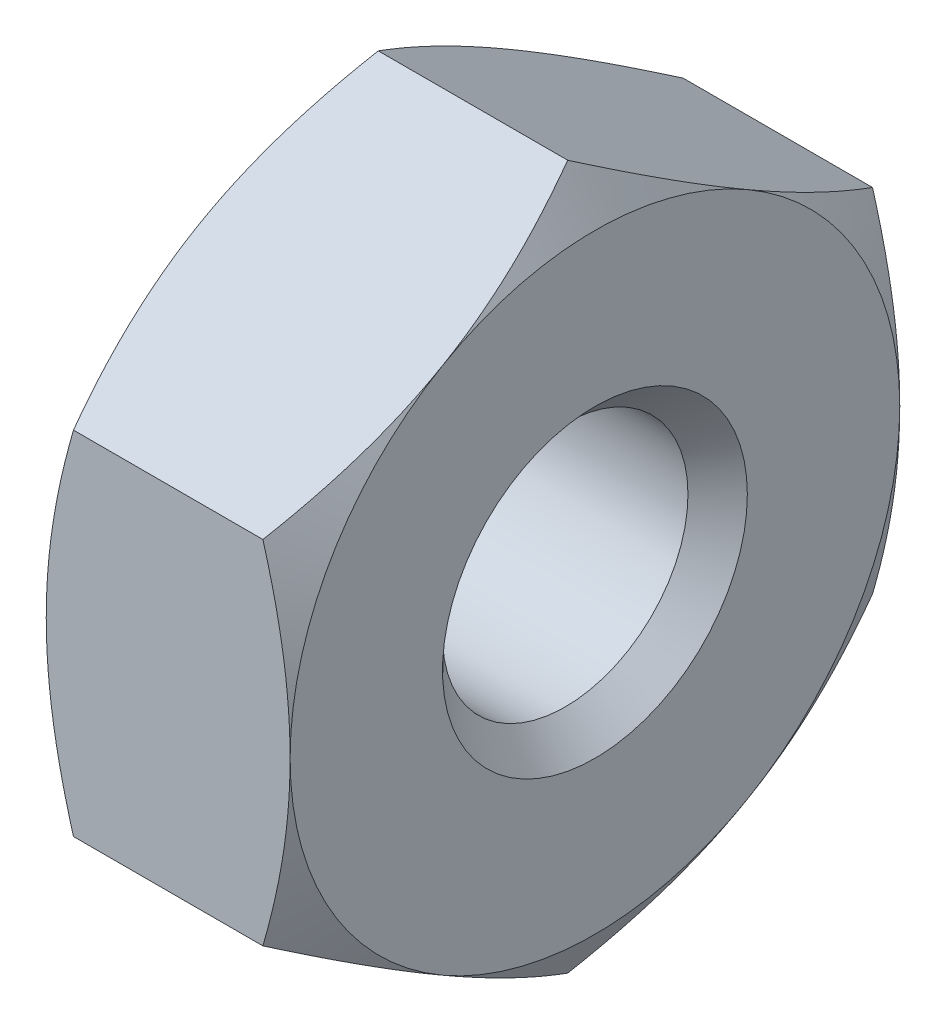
ISO-10303-21;
HEADER;
FILE_DESCRIPTION(('STEP AP214'),'2;1');
FILE_NAME('part.step','',(''),(''),'','','');
FILE_SCHEMA(('AUTOMOTIVE_DESIGN { 1 0 10303 214 1 1 1 1 }'));
ENDSEC;
DATA;
#1=APPLICATION_CONTEXT('core data for automotive mechanical design processes');
#2=APPLICATION_PROTOCOL_DEFINITION('international standard','automotive_design',2000,#1);
#3=PRODUCT_CONTEXT('',#1,'mechanical');
#4=PRODUCT('Part','Part','',(#3));
#5=PRODUCT_RELATED_PRODUCT_CATEGORY('part','',(#4));
#6=PRODUCT_DEFINITION_FORMATION('','',#4);
#7=PRODUCT_DEFINITION_CONTEXT('part definition',#1,'design');
#8=PRODUCT_DEFINITION('design','',#6,#7);
#9=PRODUCT_DEFINITION_SHAPE('','',#8);
#10=(LENGTH_UNIT() NAMED_UNIT(*) SI_UNIT(.MILLI.,.METRE.));
#11=(NAMED_UNIT(*) PLANE_ANGLE_UNIT() SI_UNIT($,.RADIAN.));
#12=(NAMED_UNIT(*) SI_UNIT($,.STERADIAN.) SOLID_ANGLE_UNIT());
#13=UNCERTAINTY_MEASURE_WITH_UNIT(LENGTH_MEASURE(1.E-05),#10,'distance_accuracy_value','');
#14=(GEOMETRIC_REPRESENTATION_CONTEXT(3) GLOBAL_UNCERTAINTY_ASSIGNED_CONTEXT((#13)) GLOBAL_UNIT_ASSIGNED_CONTEXT((#10,
#11,#12)) REPRESENTATION_CONTEXT('',''));
#15=CARTESIAN_POINT('',(0.,0.,0.));
#16=DIRECTION('',(0.,0.,1.));
#17=DIRECTION('',(1.,0.,0.));
#18=AXIS2_PLACEMENT_3D('',#15,#16,#17);
#19=CARTESIAN_POINT('',(2.,0.,0.));
#20=DIRECTION('',(-1.,0.,0.));
#21=DIRECTION('',(0.,0.,1.));
#22=AXIS2_PLACEMENT_3D('',#19,#20,#21);
#23=CONICAL_SURFACE('',#22,2.5,1.04719755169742);
#24=CARTESIAN_POINT('',(2.,0.,0.));
#25=DIRECTION('',(-1.,0.,0.));
#26=DIRECTION('',(0.,0.,1.));
#27=AXIS2_PLACEMENT_3D('',#24,#25,#26);
#28=CIRCLE('',#27,2.5);
#29=CARTESIAN_POINT('',(2.,4.80862169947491E-10,-2.5));
#30=VERTEX_POINT('',#29);
#31=CARTESIAN_POINT('',(1.99999999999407,2.16506350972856,-1.2499999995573));
#32=VERTEX_POINT('',#31);
#33=EDGE_CURVE('E129',#30,#32,#28,.F.);
#34=ORIENTED_EDGE('',*,*,#33,.F.);
#35=CARTESIAN_POINT('',(1.77670901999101,1.44337563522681,-2.50000000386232));
#36=CARTESIAN_POINT('',(1.81063132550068,1.32586499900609,-2.50000000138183));
#37=CARTESIAN_POINT('',(1.84171389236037,1.20744419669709,-2.50000000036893));
#38=CARTESIAN_POINT('',(1.89652773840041,0.9695584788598,-2.49999999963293));
#39=CARTESIAN_POINT('',(1.92029536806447,0.850101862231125,-2.49999999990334));
#40=CARTESIAN_POINT('',(1.95920267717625,0.609595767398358,-2.50000000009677));
#41=CARTESIAN_POINT('',(1.97433271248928,0.488544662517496,-2.50000000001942));
#42=CARTESIAN_POINT('',(1.98964324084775,0.306060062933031,-2.49999999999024));
#43=CARTESIAN_POINT('',(1.99351636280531,0.24492186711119,-2.49999999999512));
#44=CARTESIAN_POINT('',(1.99869890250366,0.122525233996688,-2.50000000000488));
#45=CARTESIAN_POINT('',(2.00000781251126,0.0612667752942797,-2.50000000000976));
#46=CARTESIAN_POINT('',(2.,3.39301441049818E-10,-2.5));
#47=B_SPLINE_CURVE_WITH_KNOTS('',3,(#35,#36,#37,#38,#39,#40,#41,#42,#43,#44,#45,#46),
.UNSPECIFIED.,.F.,.F.,(4,2,2,2,2,4),(0.,0.367018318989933,0.732182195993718,1.09775299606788,
1.28148745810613,1.46525829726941),.UNSPECIFIED.);
#48=CARTESIAN_POINT('',(1.77670900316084,1.44337566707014,-2.50000001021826));
#49=VERTEX_POINT('',#48);
#50=EDGE_CURVE('E21',#49,#30,#47,.T.);
#51=ORIENTED_EDGE('',*,*,#50,.F.);
#52=CARTESIAN_POINT('',(1.99999999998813,2.1650635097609,-1.24999999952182));
#53=CARTESIAN_POINT('',(2.00000781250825,2.13443012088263,-1.30305858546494));
#54=CARTESIAN_POINT('',(1.99869890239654,2.10380089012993,-1.3561099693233));
#55=CARTESIAN_POINT('',(1.99351636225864,2.04260257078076,-1.46210856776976));
#56=CARTESIAN_POINT('',(1.989643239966,2.0120334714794,-1.51505580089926));
#57=CARTESIAN_POINT('',(1.97433271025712,1.92079116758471,-1.67309210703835));
#58=CARTESIAN_POINT('',(1.95920267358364,1.86026561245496,-1.77792544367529));
#59=CARTESIAN_POINT('',(1.92029536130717,1.74001255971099,-1.98620984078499));
#60=CARTESIAN_POINT('',(1.89652772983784,1.68028424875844,-2.08966231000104));
#61=CARTESIAN_POINT('',(1.8417138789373,1.56134138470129,-2.29567739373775));
#62=CARTESIAN_POINT('',(1.81063130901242,1.50213098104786,-2.39823282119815));
#63=CARTESIAN_POINT('',(1.77670899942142,1.44337566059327,-2.50000002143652));
#64=B_SPLINE_CURVE_WITH_KNOTS('',3,(#52,#53,#54,#55,#56,#57,#58,#59,#60,#61,#62,#63),
.UNSPECIFIED.,.F.,.F.,(4,2,2,2,2,4),(0.,0.183770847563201,0.367505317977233,0.733076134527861,
1.09824002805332,1.46525836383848),.UNSPECIFIED.);
#65=EDGE_CURVE('E110',#32,#49,#64,.T.);
#66=ORIENTED_EDGE('',*,*,#65,.F.);
#67=EDGE_LOOP('',(#34,#51,#66));
#68=FACE_BOUND('',#67,.T.);
#69=ADVANCED_FACE('F17',(#68),#23,.T.);
#70=CARTESIAN_POINT('',(2.,0.,0.));
#71=DIRECTION('',(-1.,0.,0.));
#72=DIRECTION('',(0.,0.,1.));
#73=AXIS2_PLACEMENT_3D('',#70,#71,#72);
#74=CONICAL_SURFACE('',#73,2.5,1.04719755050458);
#75=CARTESIAN_POINT('',(2.,0.,0.));
#76=DIRECTION('',(-1.,0.,0.));
#77=DIRECTION('',(0.,0.,1.));
#78=AXIS2_PLACEMENT_3D('',#75,#76,#77);
#79=CIRCLE('',#78,2.5);
#80=CARTESIAN_POINT('',(1.99999999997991,2.16506350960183,1.24999999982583));
#81=VERTEX_POINT('',#80);
#82=EDGE_CURVE('E134',#32,#81,#79,.F.);
#83=ORIENTED_EDGE('',*,*,#82,.F.);
#84=CARTESIAN_POINT('',(1.77670900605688,2.88675134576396,-4.08838661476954E-10));
#85=CARTESIAN_POINT('',(1.81063131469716,2.82799602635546,-0.101767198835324));
#86=CARTESIAN_POINT('',(1.8417138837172,2.76878562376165,-0.204322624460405));
#87=CARTESIAN_POINT('',(1.89652773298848,2.64984276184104,-0.410337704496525));
#88=CARTESIAN_POINT('',(1.92029536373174,2.59011445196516,-0.513790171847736));
#89=CARTESIAN_POINT('',(1.95920267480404,2.46986140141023,-0.722074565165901));
#90=CARTESIAN_POINT('',(1.9743327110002,2.40933584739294,-0.826907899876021));
#91=CARTESIAN_POINT('',(1.98964324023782,2.31809354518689,-0.984944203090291));
#92=CARTESIAN_POINT('',(1.99351636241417,2.28752444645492,-1.03789143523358));
#93=CARTESIAN_POINT('',(1.99869890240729,2.22632612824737,-1.14389003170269));
#94=CARTESIAN_POINT('',(2.00000781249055,2.19569689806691,-1.19694141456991));
#95=CARTESIAN_POINT('',(1.99999999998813,2.1650635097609,-1.24999999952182));
#96=B_SPLINE_CURVE_WITH_KNOTS('',3,(#84,#85,#86,#87,#88,#89,#90,#91,#92,#93,#94,#95),
.UNSPECIFIED.,.F.,.F.,(4,2,2,2,2,4),(0.,0.367018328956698,0.732182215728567,1.09775302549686,
1.28148749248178,1.46525833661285),.UNSPECIFIED.);
#97=CARTESIAN_POINT('',(1.77670900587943,2.88675134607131,-1.23503307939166E-10));
#98=VERTEX_POINT('',#97);
#99=EDGE_CURVE('E116',#98,#32,#96,.T.);
#100=ORIENTED_EDGE('',*,*,#99,.F.);
#101=CARTESIAN_POINT('',(1.99999999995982,2.16506350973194,1.24999999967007));
#102=CARTESIAN_POINT('',(2.00000781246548,2.19569689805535,1.19694141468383));
#103=CARTESIAN_POINT('',(1.99869890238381,2.22632612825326,1.14389003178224));
#104=CARTESIAN_POINT('',(1.99351636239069,2.28752444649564,1.03789143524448));
#105=CARTESIAN_POINT('',(1.98964324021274,2.31809354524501,0.984944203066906));
#106=CARTESIAN_POINT('',(1.97433271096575,2.40933584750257,0.826907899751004));
#107=CARTESIAN_POINT('',(1.95920267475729,2.46986140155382,0.72207456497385));
#108=CARTESIAN_POINT('',(1.92029536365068,2.5901144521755,0.513790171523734));
#109=CARTESIAN_POINT('',(1.89652773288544,2.64984276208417,0.410337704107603));
#110=CARTESIAN_POINT('',(1.84171388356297,2.76878562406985,0.204322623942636));
#111=CARTESIAN_POINT('',(1.81063131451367,2.8279960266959,0.101767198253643));
#112=CARTESIAN_POINT('',(1.776709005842,2.88675134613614,-2.35798948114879E-10));
#113=B_SPLINE_CURVE_WITH_KNOTS('',3,(#101,#102,#103,#104,#105,#106,#107,#108,#109,#110,#111,
#112),.UNSPECIFIED.,.F.,.F.,(4,2,2,2,2,4),(0.,0.183770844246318,0.367505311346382,
0.733076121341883,1.09824000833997,1.46525833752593),.UNSPECIFIED.);
#114=EDGE_CURVE('E379',#81,#98,#113,.T.);
#115=ORIENTED_EDGE('',*,*,#114,.F.);
#116=EDGE_LOOP('',(#83,#100,#115));
#117=FACE_BOUND('',#116,.T.);
#118=ADVANCED_FACE('F378',(#117),#74,.T.);
#119=CARTESIAN_POINT('',(2.,0.,0.));
#120=DIRECTION('',(-1.,0.,0.));
#121=DIRECTION('',(0.,0.,1.));
#122=AXIS2_PLACEMENT_3D('',#119,#120,#121);
#123=CONICAL_SURFACE('',#122,2.5,1.04719755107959);
#124=CARTESIAN_POINT('',(1.77670899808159,-1.44337570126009,2.5));
#125=CARTESIAN_POINT('',(1.81063130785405,-1.32586506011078,2.5));
#126=CARTESIAN_POINT('',(1.84171387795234,-1.2074442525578,2.5));
#127=CARTESIAN_POINT('',(1.89652772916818,-0.969558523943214,2.5));
#128=CARTESIAN_POINT('',(1.92029536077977,-0.850101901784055,2.5));
#129=CARTESIAN_POINT('',(1.95920267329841,-0.609595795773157,2.5));
#130=CARTESIAN_POINT('',(1.97433271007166,-0.488544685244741,2.5));
#131=CARTESIAN_POINT('',(1.98964323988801,-0.306060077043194,2.5));
#132=CARTESIAN_POINT('',(1.99351636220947,-0.24492187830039,2.5));
#133=CARTESIAN_POINT('',(1.99869890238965,-0.12252523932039,2.5));
#134=CARTESIAN_POINT('',(2.00000781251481,-0.061266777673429,2.5));
#135=CARTESIAN_POINT('',(2.,2.24877682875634E-10,2.5));
#136=B_SPLINE_CURVE_WITH_KNOTS('',3,(#124,#125,#126,#127,#128,#129,#130,#131,#132,#133,#134,
#135),.UNSPECIFIED.,.F.,.F.,(4,2,2,2,2,4),(0.,0.367018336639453,0.732182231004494,
1.09775304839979,1.28148751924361,1.46525836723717),.UNSPECIFIED.);
#137=CARTESIAN_POINT('',(1.77670901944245,-1.44337569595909,2.49999996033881));
#138=VERTEX_POINT('',#137);
#139=CARTESIAN_POINT('',(2.,2.56379056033E-10,2.5));
#140=VERTEX_POINT('',#139);
#141=EDGE_CURVE('E148',#138,#140,#136,.T.);
#142=ORIENTED_EDGE('',*,*,#141,.F.);
#143=CARTESIAN_POINT('',(1.99999999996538,-2.16506350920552,1.25000000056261));
#144=CARTESIAN_POINT('',(2.00000781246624,-2.13443012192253,1.30305858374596));
#145=CARTESIAN_POINT('',(1.99869890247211,-2.10380089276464,1.35610996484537));
#146=CARTESIAN_POINT('',(1.99351636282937,-2.04260257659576,1.4621085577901));
#147=CARTESIAN_POINT('',(1.98964324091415,-2.01203347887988,1.51505578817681));
#148=CARTESIAN_POINT('',(1.97433271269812,-1.92079117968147,1.67309208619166));
#149=CARTESIAN_POINT('',(1.95920267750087,-1.86026562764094,1.77792541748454));
#150=CARTESIAN_POINT('',(1.92029536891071,-1.74001258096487,1.98620980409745));
#151=CARTESIAN_POINT('',(1.89652773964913,-1.68028427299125,2.08966226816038));
#152=CARTESIAN_POINT('',(1.84171389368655,-1.56134141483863,2.29567734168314));
#153=CARTESIAN_POINT('',(1.81063132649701,-1.50213101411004,2.39823276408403));
#154=CARTESIAN_POINT('',(1.77670901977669,-1.443375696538,2.4999999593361));
#155=B_SPLINE_CURVE_WITH_KNOTS('',3,(#143,#144,#145,#146,#147,#148,#149,#150,#151,#152,#153,
#154),.UNSPECIFIED.,.F.,.F.,(4,2,2,2,2,4),(0.,0.183770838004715,0.36750529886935,
0.733076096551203,1.09823997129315,1.46525828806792),.UNSPECIFIED.);
#156=CARTESIAN_POINT('',(2.,-2.16506350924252,1.25000000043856));
#157=VERTEX_POINT('',#156);
#158=EDGE_CURVE('E381',#157,#138,#155,.T.);
#159=ORIENTED_EDGE('',*,*,#158,.F.);
#160=CARTESIAN_POINT('',(2.,0.,0.));
#161=DIRECTION('',(-1.,0.,0.));
#162=DIRECTION('',(0.,0.,1.));
#163=AXIS2_PLACEMENT_3D('',#160,#161,#162);
#164=CIRCLE('',#163,2.5);
#165=EDGE_CURVE('E155',#140,#157,#164,.F.);
#166=ORIENTED_EDGE('',*,*,#165,.F.);
#167=EDGE_LOOP('',(#142,#159,#166));
#168=FACE_BOUND('',#167,.T.);
#169=ADVANCED_FACE('F181',(#168),#123,.T.);
#170=CARTESIAN_POINT('',(2.,0.,0.));
#171=DIRECTION('',(-1.,0.,0.));
#172=DIRECTION('',(0.,0.,1.));
#173=AXIS2_PLACEMENT_3D('',#170,#171,#172);
#174=CONICAL_SURFACE('',#173,2.5,1.04719755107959);
#175=CARTESIAN_POINT('',(1.77670899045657,-1.44337564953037,-2.50000001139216));
#176=CARTESIAN_POINT('',(1.81063130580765,-1.50213097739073,-2.39823281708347));
#177=CARTESIAN_POINT('',(1.84171387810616,-1.56134138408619,-2.29567739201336));
#178=CARTESIAN_POINT('',(1.89652773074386,-1.68028425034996,-2.08966231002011));
#179=CARTESIAN_POINT('',(1.920295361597,-1.7400125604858,-1.98620984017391));
#180=CARTESIAN_POINT('',(1.95920267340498,-1.86026561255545,-1.77792544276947));
#181=CARTESIAN_POINT('',(1.97433271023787,-1.92079116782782,-1.67309210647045));
#182=CARTESIAN_POINT('',(1.98964323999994,-2.01203347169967,-1.51505580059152));
#183=CARTESIAN_POINT('',(1.99351636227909,-2.04260257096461,-1.46210856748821));
#184=CARTESIAN_POINT('',(1.99869890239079,-2.10380089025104,-1.35610996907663));
#185=CARTESIAN_POINT('',(2.00000781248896,-2.13443012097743,-1.30305858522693));
#186=CARTESIAN_POINT('',(1.99999999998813,-2.16506350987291,-1.24999999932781));
#187=B_SPLINE_CURVE_WITH_KNOTS('',3,(#175,#176,#177,#178,#179,#180,#181,#182,#183,#184,#185,
#186),.UNSPECIFIED.,.F.,.F.,(4,2,2,2,2,4),(0.,0.367018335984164,0.732182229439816,
1.09775304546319,1.28148751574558,1.46525836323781),.UNSPECIFIED.);
#188=CARTESIAN_POINT('',(1.7767090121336,-1.44337565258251,-2.5));
#189=VERTEX_POINT('',#188);
#190=CARTESIAN_POINT('',(2.,-2.16506350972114,-1.24999999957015));
#191=VERTEX_POINT('',#190);
#192=EDGE_CURVE('E145',#189,#191,#187,.T.);
#193=ORIENTED_EDGE('',*,*,#192,.F.);
#194=CARTESIAN_POINT('',(2.,3.39301388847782E-10,-2.5));
#195=CARTESIAN_POINT('',(2.00000781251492,-0.0612667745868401,-2.5));
#196=CARTESIAN_POINT('',(1.99869890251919,-0.122525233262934,-2.5));
#197=CARTESIAN_POINT('',(1.99351636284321,-0.244921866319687,-2.5));
#198=CARTESIAN_POINT('',(1.98964324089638,-0.306060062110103,-2.5));
#199=CARTESIAN_POINT('',(1.97433271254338,-0.48854466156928,-2.5));
#200=CARTESIAN_POINT('',(1.95920267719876,-0.609595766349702,-2.5));
#201=CARTESIAN_POINT('',(1.92029536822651,-0.850101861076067,-2.5));
#202=CARTESIAN_POINT('',(1.89652773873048,-0.969558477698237,-2.5));
#203=CARTESIAN_POINT('',(1.84171389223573,-1.20744419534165,-2.5));
#204=CARTESIAN_POINT('',(1.81063132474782,-1.32586499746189,-2.5));
#205=CARTESIAN_POINT('',(1.77670901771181,-1.44337563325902,-2.5));
#206=B_SPLINE_CURVE_WITH_KNOTS('',3,(#194,#195,#196,#197,#198,#199,#200,#201,#202,#203,#204,
#205),.UNSPECIFIED.,.F.,.F.,(4,2,2,2,2,4),(0.,0.183770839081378,0.36750530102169,
0.733076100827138,1.09823997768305,1.46525829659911),.UNSPECIFIED.);
#207=EDGE_CURVE('E140',#30,#189,#206,.T.);
#208=ORIENTED_EDGE('',*,*,#207,.F.);
#209=CARTESIAN_POINT('',(2.,0.,0.));
#210=DIRECTION('',(-1.,0.,0.));
#211=DIRECTION('',(0.,0.,1.));
#212=AXIS2_PLACEMENT_3D('',#209,#210,#211);
#213=CIRCLE('',#212,2.5);
#214=EDGE_CURVE('E142',#191,#30,#213,.F.);
#215=ORIENTED_EDGE('',*,*,#214,.F.);
#216=EDGE_LOOP('',(#193,#208,#215));
#217=FACE_BOUND('',#216,.T.);
#218=ADVANCED_FACE('F141',(#217),#174,.T.);
#219=CARTESIAN_POINT('',(1.7565,0.,0.));
#220=DIRECTION('',(1.,0.,0.));
#221=DIRECTION('',(0.,0.,-1.));
#222=AXIS2_PLACEMENT_3D('',#219,#220,#221);
#223=CONICAL_SURFACE('',#222,1.0065,0.785398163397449);
#224=CARTESIAN_POINT('',(1.75650000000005,0.,0.));
#225=DIRECTION('',(1.,0.,0.));
#226=DIRECTION('',(0.,0.,-1.));
#227=AXIS2_PLACEMENT_3D('',#224,#225,#226);
#228=CIRCLE('',#227,1.0065);
#229=CARTESIAN_POINT('',(1.7565,0.,-1.0065));
#230=VERTEX_POINT('',#229);
#231=EDGE_CURVE('E135',#230,#230,#228,.F.);
#232=ORIENTED_EDGE('',*,*,#231,.T.);
#233=EDGE_LOOP('',(#232));
#234=FACE_BOUND('',#233,.T.);
#235=CARTESIAN_POINT('',(2.,0.,0.));
#236=DIRECTION('',(1.,0.,0.));
#237=DIRECTION('',(0.,0.,-1.));
#238=AXIS2_PLACEMENT_3D('',#235,#236,#237);
#239=CIRCLE('',#238,1.25);
#240=CARTESIAN_POINT('',(2.,0.,-1.25));
#241=VERTEX_POINT('',#240);
#242=EDGE_CURVE('E154',#241,#241,#239,.F.);
#243=ORIENTED_EDGE('',*,*,#242,.F.);
#244=EDGE_LOOP('',(#243));
#245=FACE_BOUND('',#244,.T.);
#246=ADVANCED_FACE('F180',(#234,#245),#223,.F.);
#247=CARTESIAN_POINT('',(2.,-2.53,2.53));
#248=DIRECTION('',(1.,0.,0.));
#249=DIRECTION('',(0.,0.,-1.));
#250=AXIS2_PLACEMENT_3D('',#247,#248,#249);
#251=PLANE('',#250);
#252=ORIENTED_EDGE('',*,*,#242,.T.);
#253=EDGE_LOOP('',(#252));
#254=FACE_BOUND('',#253,.T.);
#255=CARTESIAN_POINT('',(2.,0.,0.));
#256=DIRECTION('',(-1.,0.,0.));
#257=DIRECTION('',(0.,0.,1.));
#258=AXIS2_PLACEMENT_3D('',#255,#256,#257);
#259=CIRCLE('',#258,2.5);
#260=EDGE_CURVE('E153',#157,#191,#259,.F.);
#261=ORIENTED_EDGE('',*,*,#260,.T.);
#262=ORIENTED_EDGE('',*,*,#214,.T.);
#263=ORIENTED_EDGE('',*,*,#33,.T.);
#264=ORIENTED_EDGE('',*,*,#82,.T.);
#265=CARTESIAN_POINT('',(2.,0.,0.));
#266=DIRECTION('',(-1.,0.,0.));
#267=DIRECTION('',(0.,0.,1.));
#268=AXIS2_PLACEMENT_3D('',#265,#266,#267);
#269=CIRCLE('',#268,2.5);
#270=EDGE_CURVE('E216',#81,#140,#269,.F.);
#271=ORIENTED_EDGE('',*,*,#270,.T.);
#272=ORIENTED_EDGE('',*,*,#165,.T.);
#273=EDGE_LOOP('',(#261,#262,#263,#264,#271,#272));
#274=FACE_BOUND('',#273,.T.);
#275=ADVANCED_FACE('F150',(#254,#274),#251,.T.);
#276=CARTESIAN_POINT('',(2.,0.,0.));
#277=DIRECTION('',(-1.,0.,0.));
#278=DIRECTION('',(0.,0.,1.));
#279=AXIS2_PLACEMENT_3D('',#276,#277,#278);
#280=CONICAL_SURFACE('',#279,2.5,1.04719755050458);
#281=ORIENTED_EDGE('',*,*,#260,.F.);
#282=CARTESIAN_POINT('',(1.99999999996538,-2.16506350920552,1.25000000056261));
#283=CARTESIAN_POINT('',(2.00000781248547,-2.19569689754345,1.19694141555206));
#284=CARTESIAN_POINT('',(1.99869890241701,-2.22632612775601,1.14389003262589));
#285=CARTESIAN_POINT('',(1.9935163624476,-2.28752444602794,1.03789143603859));
#286=CARTESIAN_POINT('',(1.98964324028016,-2.31809354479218,0.984944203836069));
#287=CARTESIAN_POINT('',(1.97433271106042,-2.40933584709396,0.826907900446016));
#288=CARTESIAN_POINT('',(1.95920267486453,-2.46986140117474,0.722074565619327));
#289=CARTESIAN_POINT('',(1.92029536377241,-2.59011445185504,0.513790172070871));
#290=CARTESIAN_POINT('',(1.89652773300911,-2.64984276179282,0.410337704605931));
#291=CARTESIAN_POINT('',(1.84171388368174,-2.76878562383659,0.204322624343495));
#292=CARTESIAN_POINT('',(1.81063131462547,-2.82799602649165,0.101767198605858));
#293=CARTESIAN_POINT('',(1.77670900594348,-2.88675134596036,6.86537072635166E-11));
#294=B_SPLINE_CURVE_WITH_KNOTS('',3,(#282,#283,#284,#285,#286,#287,#288,#289,#290,#291,#292,
#293),.UNSPECIFIED.,.F.,.F.,(4,2,2,2,2,4),(0.,0.183770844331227,0.367505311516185,
0.733076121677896,1.09824000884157,1.46525833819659),.UNSPECIFIED.);
#295=CARTESIAN_POINT('',(1.77670900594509,-2.88675134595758,0.));
#296=VERTEX_POINT('',#295);
#297=EDGE_CURVE('E198',#157,#296,#294,.T.);
#298=ORIENTED_EDGE('',*,*,#297,.T.);
#299=CARTESIAN_POINT('',(1.7767090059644,-2.88675134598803,-8.46277451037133E-11));
#300=CARTESIAN_POINT('',(1.8106313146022,-2.82799602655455,-0.101767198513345));
#301=CARTESIAN_POINT('',(1.84171388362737,-2.76878562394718,-0.204322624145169));
#302=CARTESIAN_POINT('',(1.8965277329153,-2.64984276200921,-0.410337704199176));
#303=CARTESIAN_POINT('',(1.92029536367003,-2.59011445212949,-0.513790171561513));
#304=CARTESIAN_POINT('',(1.95920267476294,-2.46986140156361,-0.722074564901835));
#305=CARTESIAN_POINT('',(1.97433271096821,-2.40933584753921,-0.82690789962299));
#306=CARTESIAN_POINT('',(1.98964324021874,-2.31809354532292,-0.984944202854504));
#307=CARTESIAN_POINT('',(1.99351636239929,-2.28752444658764,-1.03789143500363));
#308=CARTESIAN_POINT('',(1.99869890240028,-2.22632612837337,-1.14389003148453));
#309=CARTESIAN_POINT('',(2.00000781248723,-2.19569689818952,-1.1969414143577));
#310=CARTESIAN_POINT('',(1.99999999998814,-2.16506350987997,-1.24999999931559));
#311=B_SPLINE_CURVE_WITH_KNOTS('',3,(#299,#300,#301,#302,#303,#304,#305,#306,#307,#308,#309,
#310),.UNSPECIFIED.,.F.,.F.,(4,2,2,2,2,4),(0.,0.367018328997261,0.732182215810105,
1.0977530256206,1.28148749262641,1.46525833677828),.UNSPECIFIED.);
#312=EDGE_CURVE('E204',#296,#191,#311,.T.);
#313=ORIENTED_EDGE('',*,*,#312,.T.);
#314=EDGE_LOOP('',(#281,#298,#313));
#315=FACE_BOUND('',#314,.T.);
#316=ADVANCED_FACE('F188',(#315),#280,.T.);
#317=CARTESIAN_POINT('',(2.,0.,0.));
#318=DIRECTION('',(-1.,0.,0.));
#319=DIRECTION('',(0.,0.,1.));
#320=AXIS2_PLACEMENT_3D('',#317,#318,#319);
#321=CONICAL_SURFACE('',#320,2.5,1.04719755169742);
#322=ORIENTED_EDGE('',*,*,#270,.F.);
#323=CARTESIAN_POINT('',(1.99999999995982,2.16506350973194,1.24999999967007));
#324=CARTESIAN_POINT('',(2.00000781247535,2.13443012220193,1.30305858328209));
#325=CARTESIAN_POINT('',(1.99869890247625,2.10380089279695,1.35610996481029));
#326=CARTESIAN_POINT('',(1.99351636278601,2.04260257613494,1.46210855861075));
#327=CARTESIAN_POINT('',(1.98964324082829,2.01203347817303,1.51505578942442));
#328=CARTESIAN_POINT('',(1.97433271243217,1.92079117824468,1.67309208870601));
#329=CARTESIAN_POINT('',(1.95920267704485,1.86026562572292,1.77792542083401));
#330=CARTESIAN_POINT('',(1.92029536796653,1.74001257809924,1.98620980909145));
#331=CARTESIAN_POINT('',(1.89652773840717,1.6802842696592,2.08966227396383));
#332=CARTESIAN_POINT('',(1.84171389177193,1.56134141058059,2.29567734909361));
#333=CARTESIAN_POINT('',(1.81063132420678,1.50213100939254,2.39823277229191));
#334=CARTESIAN_POINT('',(1.77670901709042,1.44337569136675,2.49999996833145));
#335=B_SPLINE_CURVE_WITH_KNOTS('',3,(#323,#324,#325,#326,#327,#328,#329,#330,#331,#332,#333,
#334),.UNSPECIFIED.,.F.,.F.,(4,2,2,2,2,4),(0.,0.183770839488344,0.367505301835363,
0.733076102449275,1.09823998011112,1.46525829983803),.UNSPECIFIED.);
#336=CARTESIAN_POINT('',(1.77670900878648,1.44337569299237,2.49999998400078));
#337=VERTEX_POINT('',#336);
#338=EDGE_CURVE('E282',#81,#337,#335,.T.);
#339=ORIENTED_EDGE('',*,*,#338,.T.);
#340=CARTESIAN_POINT('',(1.77670900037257,1.44337569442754,2.5));
#341=CARTESIAN_POINT('',(1.81063130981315,1.32586505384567,2.5));
#342=CARTESIAN_POINT('',(1.84171387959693,1.20744424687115,2.5));
#343=CARTESIAN_POINT('',(1.89652773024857,0.969558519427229,2.5));
#344=CARTESIAN_POINT('',(1.92029536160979,0.850101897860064,2.5));
#345=CARTESIAN_POINT('',(1.95920267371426,0.609595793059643,2.5));
#346=CARTESIAN_POINT('',(1.97433271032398,0.488544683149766,2.5));
#347=CARTESIAN_POINT('',(1.98964323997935,0.306060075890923,2.5));
#348=CARTESIAN_POINT('',(1.9935163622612,0.244921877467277,2.5));
#349=CARTESIAN_POINT('',(1.99869890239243,0.122525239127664,2.5));
#350=CARTESIAN_POINT('',(2.00000781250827,0.0612667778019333,2.5));
#351=CARTESIAN_POINT('',(2.,2.24877073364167E-10,2.5));
#352=B_SPLINE_CURVE_WITH_KNOTS('',3,(#340,#341,#342,#343,#344,#345,#346,#347,#348,#349,#350,
#351),.UNSPECIFIED.,.F.,.F.,(4,2,2,2,2,4),(0.,0.367018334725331,0.732182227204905,
1.09775304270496,1.28148751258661,1.46525835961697),.UNSPECIFIED.);
#353=EDGE_CURVE('E210',#337,#140,#352,.T.);
#354=ORIENTED_EDGE('',*,*,#353,.T.);
#355=EDGE_LOOP('',(#322,#339,#354));
#356=FACE_BOUND('',#355,.T.);
#357=ADVANCED_FACE('F192',(#356),#321,.T.);
#358=CARTESIAN_POINT('',(2.012,-1.443375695,2.5));
#359=DIRECTION('',(0.,0.,-1.));
#360=DIRECTION('',(-1.,0.,0.));
#361=AXIS2_PLACEMENT_3D('',#358,#359,#360);
#362=PLANE('',#361);
#363=ORIENTED_EDGE('',*,*,#141,.T.);
#364=ORIENTED_EDGE('',*,*,#353,.F.);
#365=DIRECTION('',(-1.,0.,0.));
#366=VECTOR('',#365,1.);
#367=CARTESIAN_POINT('',(1.,1.44337567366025,2.499999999));
#368=LINE('',#367,#366);
#369=CARTESIAN_POINT('',(0.223290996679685,1.44337566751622,2.50000000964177));
#370=VERTEX_POINT('',#369);
#371=EDGE_CURVE('E286',#337,#370,#368,.T.);
#372=ORIENTED_EDGE('',*,*,#371,.T.);
#373=CARTESIAN_POINT('',(0.223290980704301,1.44337563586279,2.50000000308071));
#374=CARTESIAN_POINT('',(0.189368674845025,1.32586499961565,2.50000000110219));
#375=CARTESIAN_POINT('',(0.158286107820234,1.20744419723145,2.50000000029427));
#376=CARTESIAN_POINT('',(0.103472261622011,0.969558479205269,2.49999999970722));
#377=CARTESIAN_POINT('',(0.079704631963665,0.85010186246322,2.4999999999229));
#378=CARTESIAN_POINT('',(0.0407973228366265,0.609595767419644,2.50000000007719));
#379=CARTESIAN_POINT('',(0.0256672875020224,0.488544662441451,2.50000000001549));
#380=CARTESIAN_POINT('',(0.0103567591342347,0.306060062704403,2.49999999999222));
#381=CARTESIAN_POINT('',(0.00648363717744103,0.24492186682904,2.49999999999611));
#382=CARTESIAN_POINT('',(0.00130109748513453,0.122525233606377,2.50000000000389));
#383=CARTESIAN_POINT('',(-7.81251714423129E-06,0.0612667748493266,2.50000000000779));
#384=CARTESIAN_POINT('',(0.,-1.59690836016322E-10,2.5));
#385=B_SPLINE_CURVE_WITH_KNOTS('',3,(#373,#374,#375,#376,#377,#378,#379,#380,#381,#382,#383,
#384),.UNSPECIFIED.,.F.,.F.,(4,2,2,2,2,4),(0.,0.367018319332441,0.732182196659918,
1.09775299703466,1.28148745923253,1.46525829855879),.UNSPECIFIED.);
#386=CARTESIAN_POINT('',(0.,-3.36224056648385E-10,2.5));
#387=VERTEX_POINT('',#386);
#388=EDGE_CURVE('E227',#370,#387,#385,.T.);
#389=ORIENTED_EDGE('',*,*,#388,.T.);
#390=CARTESIAN_POINT('',(0.,-1.59690805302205E-10,2.5));
#391=CARTESIAN_POINT('',(-7.81250935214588E-06,-0.0612667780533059,2.5));
#392=CARTESIAN_POINT('',(0.00130109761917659,-0.122525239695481,2.5));
#393=CARTESIAN_POINT('',(0.00648363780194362,-0.244921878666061,2.5));
#394=CARTESIAN_POINT('',(0.0103567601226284,-0.30606007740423,2.5));
#395=CARTESIAN_POINT('',(0.0256672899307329,-0.488544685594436,2.5));
#396=CARTESIAN_POINT('',(0.0407973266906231,-0.60959579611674,2.5));
#397=CARTESIAN_POINT('',(0.079704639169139,-0.850101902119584,2.5));
#398=CARTESIAN_POINT('',(0.103472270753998,-0.969558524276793,2.5));
#399=CARTESIAN_POINT('',(0.158286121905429,-1.20744425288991,2.5));
#400=CARTESIAN_POINT('',(0.189368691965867,-1.32586506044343,2.5));
#401=CARTESIAN_POINT('',(0.223291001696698,-1.4433757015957,2.5));
#402=B_SPLINE_CURVE_WITH_KNOTS('',3,(#390,#391,#392,#393,#394,#395,#396,#397,#398,#399,#400,
#401),.UNSPECIFIED.,.F.,.F.,(4,2,2,2,2,4),(0.,0.183770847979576,0.367505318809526,
0.73307613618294,1.09824003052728,1.46525836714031),.UNSPECIFIED.);
#403=CARTESIAN_POINT('',(0.223290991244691,-1.44337569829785,2.499999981));
#404=VERTEX_POINT('',#403);
#405=EDGE_CURVE('E234',#387,#404,#402,.T.);
#406=ORIENTED_EDGE('',*,*,#405,.T.);
#407=DIRECTION('',(1.,0.,0.));
#408=VECTOR('',#407,1.);
#409=CARTESIAN_POINT('',(1.,-1.443375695,2.499999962));
#410=LINE('',#409,#408);
#411=EDGE_CURVE('E209',#404,#138,#410,.T.);
#412=ORIENTED_EDGE('',*,*,#411,.T.);
#413=EDGE_LOOP('',(#363,#364,#372,#389,#406,#412));
#414=FACE_BOUND('',#413,.T.);
#415=ADVANCED_FACE('F217',(#414),#362,.F.);
#416=CARTESIAN_POINT('',(-0.012,-1.443375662,-2.500000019));
#417=DIRECTION('',(0.,0.866025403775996,0.500000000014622));
#418=DIRECTION('',(0.,-0.500000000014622,0.866025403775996));
#419=AXIS2_PLACEMENT_3D('',#416,#417,#418);
#420=PLANE('',#419);
#421=DIRECTION('',(1.,0.,0.));
#422=VECTOR('',#421,1.);
#423=CARTESIAN_POINT('',(1.,-1.44337567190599,-2.5));
#424=LINE('',#423,#422);
#425=CARTESIAN_POINT('',(0.223290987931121,-1.44337568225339,-2.49999998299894));
#426=VERTEX_POINT('',#425);
#427=EDGE_CURVE('E287',#426,#189,#424,.T.);
#428=ORIENTED_EDGE('',*,*,#427,.T.);
#429=ORIENTED_EDGE('',*,*,#192,.T.);
#430=ORIENTED_EDGE('',*,*,#312,.F.);
#431=DIRECTION('',(-1.,0.,0.));
#432=VECTOR('',#431,1.);
#433=CARTESIAN_POINT('',(1.,-2.886751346,0.));
#434=LINE('',#433,#432);
#435=CARTESIAN_POINT('',(0.22329099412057,-2.88675134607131,-1.23503348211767E-10));
#436=VERTEX_POINT('',#435);
#437=EDGE_CURVE('E293',#296,#436,#434,.T.);
#438=ORIENTED_EDGE('',*,*,#437,.T.);
#439=CARTESIAN_POINT('',(0.223290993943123,-2.88675134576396,-4.08838500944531E-10));
#440=CARTESIAN_POINT('',(0.189368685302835,-2.82799602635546,-0.101767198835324));
#441=CARTESIAN_POINT('',(0.158286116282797,-2.76878562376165,-0.204322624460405));
#442=CARTESIAN_POINT('',(0.103472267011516,-2.64984276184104,-0.410337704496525));
#443=CARTESIAN_POINT('',(0.0797046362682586,-2.59011445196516,-0.513790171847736));
#444=CARTESIAN_POINT('',(0.0407973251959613,-2.46986140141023,-0.722074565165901));
#445=CARTESIAN_POINT('',(0.0256672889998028,-2.40933584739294,-0.826907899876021));
#446=CARTESIAN_POINT('',(0.0103567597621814,-2.31809354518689,-0.984944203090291));
#447=CARTESIAN_POINT('',(0.00648363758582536,-2.28752444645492,-1.03789143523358));
#448=CARTESIAN_POINT('',(0.00130109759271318,-2.22632612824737,-1.14389003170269));
#449=CARTESIAN_POINT('',(-7.81249054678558E-06,-2.19569689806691,-1.19694141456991));
#450=CARTESIAN_POINT('',(1.18653432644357E-11,-2.1650635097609,-1.24999999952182));
#451=B_SPLINE_CURVE_WITH_KNOTS('',3,(#439,#440,#441,#442,#443,#444,#445,#446,#447,#448,#449,
#450),.UNSPECIFIED.,.F.,.F.,(4,2,2,2,2,4),(0.,0.367018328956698,0.732182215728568,
1.09775302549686,1.28148749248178,1.46525833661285),.UNSPECIFIED.);
#452=CARTESIAN_POINT('',(5.93273425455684E-12,-2.16506350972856,-1.2499999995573));
#453=VERTEX_POINT('',#452);
#454=EDGE_CURVE('E337',#436,#453,#451,.T.);
#455=ORIENTED_EDGE('',*,*,#454,.T.);
#456=CARTESIAN_POINT('',(1.18653433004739E-11,-2.1650635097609,-1.24999999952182));
#457=CARTESIAN_POINT('',(-7.81250684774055E-06,-2.13443012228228,-1.30305858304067));
#458=CARTESIAN_POINT('',(0.00130109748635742,-2.10380089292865,-1.35610996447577));
#459=CARTESIAN_POINT('',(0.00648363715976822,-2.04260257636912,-1.46210855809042));
#460=CARTESIAN_POINT('',(0.0103567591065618,-2.01203347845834,-1.51505578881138));
#461=CARTESIAN_POINT('',(0.0256672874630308,-1.92079117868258,-1.67309208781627));
#462=CARTESIAN_POINT('',(0.0407973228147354,-1.86026562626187,-1.77792541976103));
#463=CARTESIAN_POINT('',(0.0797046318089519,-1.74001257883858,-1.98620980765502));
#464=CARTESIAN_POINT('',(0.103472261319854,-1.6802842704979,-2.0896622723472));
#465=CARTESIAN_POINT('',(0.158286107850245,-1.5613414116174,-2.29567734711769));
#466=CARTESIAN_POINT('',(0.189368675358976,-1.50213101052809,-2.3982327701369));
#467=CARTESIAN_POINT('',(0.22329098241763,-1.44337569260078,-2.49999996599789));
#468=B_SPLINE_CURVE_WITH_KNOTS('',3,(#456,#457,#458,#459,#460,#461,#462,#463,#464,#465,#466,
#467),.UNSPECIFIED.,.F.,.F.,(4,2,2,2,2,4),(0.,0.183770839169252,0.367505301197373,
0.733076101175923,1.09823997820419,1.46525829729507),.UNSPECIFIED.);
#469=EDGE_CURVE('E347',#453,#426,#468,.T.);
#470=ORIENTED_EDGE('',*,*,#469,.T.);
#471=EDGE_LOOP('',(#428,#429,#430,#438,#455,#470));
#472=FACE_BOUND('',#471,.T.);
#473=ADVANCED_FACE('F172',(#472),#420,.F.);
#474=CARTESIAN_POINT('',(-0.012,-2.886751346,0.));
#475=DIRECTION('',(0.,0.866025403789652,-0.499999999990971));
#476=DIRECTION('',(0.,0.499999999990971,0.866025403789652));
#477=AXIS2_PLACEMENT_3D('',#474,#475,#476);
#478=PLANE('',#477);
#479=ORIENTED_EDGE('',*,*,#297,.F.);
#480=ORIENTED_EDGE('',*,*,#158,.T.);
#481=ORIENTED_EDGE('',*,*,#411,.F.);
#482=CARTESIAN_POINT('',(0.223290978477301,-1.44337569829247,2.49999996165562));
#483=CARTESIAN_POINT('',(0.189368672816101,-1.50213101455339,2.3982327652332));
#484=CARTESIAN_POINT('',(0.158286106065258,-1.56134141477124,2.29567734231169));
#485=CARTESIAN_POINT('',(0.10347226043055,-1.68028427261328,2.08966226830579));
#486=CARTESIAN_POINT('',(0.0797046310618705,-1.74001258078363,1.98620980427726));
#487=CARTESIAN_POINT('',(0.0407973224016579,-1.86026562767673,1.7779254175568));
#488=CARTESIAN_POINT('',(0.025667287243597,-1.92079117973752,1.67309208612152));
#489=CARTESIAN_POINT('',(0.0103567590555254,-2.0120334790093,1.51505578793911));
#490=CARTESIAN_POINT('',(0.00648363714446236,-2.04260257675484,1.46210855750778));
#491=CARTESIAN_POINT('',(0.00130109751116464,-2.10380089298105,1.35610996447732));
#492=CARTESIAN_POINT('',(-7.81247783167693E-06,-2.13443012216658,1.3030585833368));
#493=CARTESIAN_POINT('',(3.46240322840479E-11,-2.16506350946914,1.25000000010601));
#494=B_SPLINE_CURVE_WITH_KNOTS('',3,(#482,#483,#484,#485,#486,#487,#488,#489,#490,#491,#492,
#493),.UNSPECIFIED.,.F.,.F.,(4,2,2,2,2,4),(0.,0.367018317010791,0.732182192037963,
1.09775299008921,1.28148745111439,1.4652582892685),.UNSPECIFIED.);
#495=CARTESIAN_POINT('',(1.73122039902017E-11,-2.16506350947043,1.2500000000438));
#496=VERTEX_POINT('',#495);
#497=EDGE_CURVE('E241',#404,#496,#494,.T.);
#498=ORIENTED_EDGE('',*,*,#497,.T.);
#499=CARTESIAN_POINT('',(3.46240949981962E-11,-2.16506350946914,1.25000000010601));
#500=CARTESIAN_POINT('',(-7.81247800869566E-06,-2.19569689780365,1.19694141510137));
#501=CARTESIAN_POINT('',(0.00130109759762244,-2.22632612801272,1.14389003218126));
#502=CARTESIAN_POINT('',(0.00648363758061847,-2.28752444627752,1.0378914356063));
#503=CARTESIAN_POINT('',(0.0103567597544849,-2.31809354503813,0.984944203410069));
#504=CARTESIAN_POINT('',(0.0256672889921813,-2.40933584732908,0.82690790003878));
#505=CARTESIAN_POINT('',(0.0407973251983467,-2.4698614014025,0.722074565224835));
#506=CARTESIAN_POINT('',(0.0797046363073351,-2.59011445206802,0.513790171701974));
#507=CARTESIAN_POINT('',(0.103472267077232,-2.64984276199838,0.410337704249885));
#508=CARTESIAN_POINT('',(0.158286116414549,-2.76878562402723,0.204322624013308));
#509=CARTESIAN_POINT('',(0.189368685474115,-2.82799602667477,0.101767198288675));
#510=CARTESIAN_POINT('',(0.223290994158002,-2.88675134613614,-2.35799283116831E-10));
#511=B_SPLINE_CURVE_WITH_KNOTS('',3,(#499,#500,#501,#502,#503,#504,#505,#506,#507,#508,#509,
#510),.UNSPECIFIED.,.F.,.F.,(4,2,2,2,2,4),(0.,0.183770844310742,0.3675053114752,
0.733076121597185,1.09824000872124,1.46525833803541),.UNSPECIFIED.);
#512=EDGE_CURVE('E305',#496,#436,#511,.T.);
#513=ORIENTED_EDGE('',*,*,#512,.T.);
#514=ORIENTED_EDGE('',*,*,#437,.F.);
#515=EDGE_LOOP('',(#479,#480,#481,#498,#513,#514));
#516=FACE_BOUND('',#515,.T.);
#517=ADVANCED_FACE('F431',(#516),#478,.F.);
#518=CARTESIAN_POINT('',(0.2435,0.,0.));
#519=DIRECTION('',(1.,0.,0.));
#520=DIRECTION('',(0.,0.,-1.));
#521=AXIS2_PLACEMENT_3D('',#518,#519,#520);
#522=CYLINDRICAL_SURFACE('',#521,1.0065);
#523=CARTESIAN_POINT('',(0.243499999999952,0.,0.));
#524=DIRECTION('',(-1.,0.,0.));
#525=DIRECTION('',(0.,-1.,0.));
#526=AXIS2_PLACEMENT_3D('',#523,#524,#525);
#527=CIRCLE('',#526,1.0065);
#528=CARTESIAN_POINT('',(0.2435,-1.0065,0.));
#529=VERTEX_POINT('',#528);
#530=EDGE_CURVE('E302',#529,#529,#527,.F.);
#531=ORIENTED_EDGE('',*,*,#530,.F.);
#532=EDGE_LOOP('',(#531));
#533=FACE_BOUND('',#532,.T.);
#534=ORIENTED_EDGE('',*,*,#231,.F.);
#535=EDGE_LOOP('',(#534));
#536=FACE_BOUND('',#535,.T.);
#537=ADVANCED_FACE('F251',(#533,#536),#522,.F.);
#538=CARTESIAN_POINT('',(-0.012,-1.443375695,-2.5));
#539=DIRECTION('',(0.,0.,1.));
#540=DIRECTION('',(1.,0.,0.));
#541=AXIS2_PLACEMENT_3D('',#538,#539,#540);
#542=PLANE('',#541);
#543=DIRECTION('',(1.,0.,0.));
#544=VECTOR('',#543,1.);
#545=CARTESIAN_POINT('',(1.,1.44337567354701,-2.499999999));
#546=LINE('',#545,#544);
#547=CARTESIAN_POINT('',(0.223290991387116,1.4433756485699,-2.5000000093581));
#548=VERTEX_POINT('',#547);
#549=EDGE_CURVE('E114',#548,#49,#546,.T.);
#550=ORIENTED_EDGE('',*,*,#549,.T.);
#551=ORIENTED_EDGE('',*,*,#50,.T.);
#552=ORIENTED_EDGE('',*,*,#207,.T.);
#553=ORIENTED_EDGE('',*,*,#427,.F.);
#554=CARTESIAN_POINT('',(0.223291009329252,-1.44337569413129,-2.49999998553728));
#555=CARTESIAN_POINT('',(0.189368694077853,-1.32586505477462,-2.49999999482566));
#556=CARTESIAN_POINT('',(0.158286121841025,-1.20744424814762,-2.49999999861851));
#557=CARTESIAN_POINT('',(0.10347226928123,-0.969558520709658,-2.50000000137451));
#558=CARTESIAN_POINT('',(0.0797046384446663,-0.850101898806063,-2.50000000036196));
#559=CARTESIAN_POINT('',(0.040797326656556,-0.609595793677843,-2.49999999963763));
#560=CARTESIAN_POINT('',(0.0256672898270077,-0.488544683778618,-2.4999999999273));
#561=CARTESIAN_POINT('',(0.0103567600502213,-0.306060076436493,-2.50000000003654));
#562=CARTESIAN_POINT('',(0.00648363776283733,-0.244921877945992,-2.50000000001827));
#563=CARTESIAN_POINT('',(0.00130109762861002,-0.12252523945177,-2.49999999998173));
#564=CARTESIAN_POINT('',(-7.8124838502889E-06,-0.0612667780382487,-2.49999999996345));
#565=CARTESIAN_POINT('',(0.,-3.81991718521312E-10,-2.5));
#566=B_SPLINE_CURVE_WITH_KNOTS('',3,(#554,#555,#556,#557,#558,#559,#560,#561,#562,#563,#564,
#565),.UNSPECIFIED.,.F.,.F.,(4,2,2,2,2,4),(0.,0.3670183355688,0.732182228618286,
1.09775304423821,1.28148751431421,1.46525836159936),.UNSPECIFIED.);
#567=CARTESIAN_POINT('',(0.,-6.71858319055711E-10,-2.5));
#568=VERTEX_POINT('',#567);
#569=EDGE_CURVE('E342',#426,#568,#566,.T.);
#570=ORIENTED_EDGE('',*,*,#569,.T.);
#571=CARTESIAN_POINT('',(0.,-3.81991992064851E-10,-2.5));
#572=CARTESIAN_POINT('',(-7.81251556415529E-06,0.0612667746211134,-2.5));
#573=CARTESIAN_POINT('',(0.0013010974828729,0.122525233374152,-2.5));
#574=CARTESIAN_POINT('',(0.00648363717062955,0.244921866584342,-2.5));
#575=CARTESIAN_POINT('',(0.0103567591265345,0.306060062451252,-2.5));
#576=CARTESIAN_POINT('',(0.0256672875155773,0.488544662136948,-2.5));
#577=CARTESIAN_POINT('',(0.0407973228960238,0.609595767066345,-2.5));
#578=CARTESIAN_POINT('',(0.0797046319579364,0.850101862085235,-2.5));
#579=CARTESIAN_POINT('',(0.103472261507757,0.969558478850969,-2.5));
#580=CARTESIAN_POINT('',(0.158286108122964,1.20744419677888,-2.5));
#581=CARTESIAN_POINT('',(0.189368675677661,1.32586499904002,-2.5));
#582=CARTESIAN_POINT('',(0.22329098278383,1.44337563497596,-2.5));
#583=B_SPLINE_CURVE_WITH_KNOTS('',3,(#571,#572,#573,#574,#575,#576,#577,#578,#579,#580,#581,
#582),.UNSPECIFIED.,.F.,.F.,(4,2,2,2,2,4),(0.,0.183770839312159,0.36750530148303,
0.733076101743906,1.09823997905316,1.46525829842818),.UNSPECIFIED.);
#584=EDGE_CURVE('E124',#568,#548,#583,.T.);
#585=ORIENTED_EDGE('',*,*,#584,.T.);
#586=EDGE_LOOP('',(#550,#551,#552,#553,#570,#585));
#587=FACE_BOUND('',#586,.T.);
#588=ADVANCED_FACE('F123',(#587),#542,.F.);
#589=CARTESIAN_POINT('',(-0.012,1.443375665,2.500000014));
#590=DIRECTION('',(0.,-0.866025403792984,-0.499999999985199));
#591=DIRECTION('',(0.,0.499999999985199,-0.866025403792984));
#592=AXIS2_PLACEMENT_3D('',#589,#590,#591);
#593=PLANE('',#592);
#594=ORIENTED_EDGE('',*,*,#338,.F.);
#595=ORIENTED_EDGE('',*,*,#114,.T.);
#596=DIRECTION('',(-1.,0.,0.));
#597=VECTOR('',#596,1.);
#598=CARTESIAN_POINT('',(1.,2.886751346,0.));
#599=LINE('',#598,#597);
#600=CARTESIAN_POINT('',(0.223290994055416,2.88675134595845,-7.19603222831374E-11));
#601=VERTEX_POINT('',#600);
#602=EDGE_CURVE('E125',#98,#601,#599,.T.);
#603=ORIENTED_EDGE('',*,*,#602,.T.);
#604=CARTESIAN_POINT('',(0.223290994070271,2.88675134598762,2.48832820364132E-11));
#605=CARTESIAN_POINT('',(0.189368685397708,2.82799602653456,0.101767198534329));
#606=CARTESIAN_POINT('',(0.158286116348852,2.76878562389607,0.204322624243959));
#607=CARTESIAN_POINT('',(0.10347226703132,2.64984276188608,0.410337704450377));
#608=CARTESIAN_POINT('',(0.0797046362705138,2.59011445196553,0.513790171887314));
#609=CARTESIAN_POINT('',(0.0407973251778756,2.46986140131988,0.722074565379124));
#610=CARTESIAN_POINT('',(0.025667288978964,2.40933584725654,0.82690790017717));
#611=CARTESIAN_POINT('',(0.0103567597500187,2.318093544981,0.984944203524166));
#612=CARTESIAN_POINT('',(0.00648363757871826,2.28752444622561,1.03789143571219));
#613=CARTESIAN_POINT('',(0.00130109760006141,2.22632612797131,1.1438900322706));
#614=CARTESIAN_POINT('',(-7.81247379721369E-06,2.19569689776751,1.19694141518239));
#615=CARTESIAN_POINT('',(4.01777139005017E-11,2.16506350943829,1.25000000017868));
#616=B_SPLINE_CURVE_WITH_KNOTS('',3,(#604,#605,#606,#607,#608,#609,#610,#611,#612,#613,#614,
#615),.UNSPECIFIED.,.F.,.F.,(4,2,2,2,2,4),(0.,0.367018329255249,0.732182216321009,
1.09775302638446,1.28148749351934,1.46525833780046),.UNSPECIFIED.);
#617=CARTESIAN_POINT('',(2.00888569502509E-11,2.16506350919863,1.2500000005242));
#618=VERTEX_POINT('',#617);
#619=EDGE_CURVE('E268',#601,#618,#616,.T.);
#620=ORIENTED_EDGE('',*,*,#619,.T.);
#621=CARTESIAN_POINT('',(4.01775885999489E-11,2.16506350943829,1.25000000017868));
#622=CARTESIAN_POINT('',(-7.81246836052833E-06,2.13443012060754,1.30305858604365));
#623=CARTESIAN_POINT('',(0.00130109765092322,2.10380088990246,1.35610996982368));
#624=CARTESIAN_POINT('',(0.00648363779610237,2.0426025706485,1.46210856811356));
#625=CARTESIAN_POINT('',(0.0103567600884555,2.01203347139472,1.51505580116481));
#626=CARTESIAN_POINT('',(0.0256672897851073,1.92079116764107,1.67309210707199));
#627=CARTESIAN_POINT('',(0.0407973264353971,1.86026561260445,1.77792544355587));
#628=CARTESIAN_POINT('',(0.0797046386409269,1.74001256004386,1.98620984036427));
#629=CARTESIAN_POINT('',(0.103472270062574,1.68028424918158,2.08966230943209));
#630=CARTESIAN_POINT('',(0.1582861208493,1.56134138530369,2.29567739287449));
#631=CARTESIAN_POINT('',(0.189368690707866,1.50213098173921,2.39823282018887));
#632=CARTESIAN_POINT('',(0.223291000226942,1.4433756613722,2.50000002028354));
#633=B_SPLINE_CURVE_WITH_KNOTS('',3,(#621,#622,#623,#624,#625,#626,#627,#628,#629,#630,#631,
#632),.UNSPECIFIED.,.F.,.F.,(4,2,2,2,2,4),(0.,0.183770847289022,0.36750531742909,
0.733076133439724,1.09824002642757,1.46525836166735),.UNSPECIFIED.);
#634=EDGE_CURVE('E261',#618,#370,#633,.T.);
#635=ORIENTED_EDGE('',*,*,#634,.T.);
#636=ORIENTED_EDGE('',*,*,#371,.F.);
#637=EDGE_LOOP('',(#594,#595,#603,#620,#635,#636));
#638=FACE_BOUND('',#637,.T.);
#639=ADVANCED_FACE('F249',(#638),#593,.F.);
#640=CARTESIAN_POINT('',(0.,0.,0.));
#641=DIRECTION('',(1.,0.,0.));
#642=DIRECTION('',(0.,0.,-1.));
#643=AXIS2_PLACEMENT_3D('',#640,#641,#642);
#644=CONICAL_SURFACE('',#643,2.5,1.04719755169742);
#645=CARTESIAN_POINT('',(0.,0.,0.));
#646=DIRECTION('',(1.,0.,0.));
#647=DIRECTION('',(0.,0.,-1.));
#648=AXIS2_PLACEMENT_3D('',#645,#646,#647);
#649=CIRCLE('',#648,2.5);
#650=EDGE_CURVE('E300',#496,#387,#649,.F.);
#651=ORIENTED_EDGE('',*,*,#650,.F.);
#652=ORIENTED_EDGE('',*,*,#497,.F.);
#653=ORIENTED_EDGE('',*,*,#405,.F.);
#654=EDGE_LOOP('',(#651,#652,#653));
#655=FACE_BOUND('',#654,.T.);
#656=ADVANCED_FACE('F245',(#655),#644,.T.);
#657=CARTESIAN_POINT('',(0.,0.,0.));
#658=DIRECTION('',(1.,0.,0.));
#659=DIRECTION('',(0.,0.,-1.));
#660=AXIS2_PLACEMENT_3D('',#657,#658,#659);
#661=CONICAL_SURFACE('',#660,2.5,1.04719755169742);
#662=CARTESIAN_POINT('',(0.,0.,0.));
#663=DIRECTION('',(1.,0.,0.));
#664=DIRECTION('',(0.,0.,-1.));
#665=AXIS2_PLACEMENT_3D('',#662,#663,#664);
#666=CIRCLE('',#665,2.5);
#667=EDGE_CURVE('E362',#387,#618,#666,.F.);
#668=ORIENTED_EDGE('',*,*,#667,.F.);
#669=ORIENTED_EDGE('',*,*,#388,.F.);
#670=ORIENTED_EDGE('',*,*,#634,.F.);
#671=EDGE_LOOP('',(#668,#669,#670));
#672=FACE_BOUND('',#671,.T.);
#673=ADVANCED_FACE('F248',(#672),#661,.T.);
#674=CARTESIAN_POINT('',(0.,0.,0.));
#675=DIRECTION('',(1.,0.,0.));
#676=DIRECTION('',(0.,0.,-1.));
#677=AXIS2_PLACEMENT_3D('',#674,#675,#676);
#678=CONICAL_SURFACE('',#677,2.5,1.04719755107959);
#679=CARTESIAN_POINT('',(3.63036709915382E-11,2.16506350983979,-1.24999999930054));
#680=CARTESIAN_POINT('',(-7.81250240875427E-06,2.13443012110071,-1.303058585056));
#681=CARTESIAN_POINT('',(0.00130109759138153,2.1038008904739,-1.35610996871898));
#682=CARTESIAN_POINT('',(0.00648363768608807,2.04260257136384,-1.46210856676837));
#683=CARTESIAN_POINT('',(0.0103567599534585,2.01203347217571,-1.5150557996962));
#684=CARTESIAN_POINT('',(0.0256672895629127,1.92079116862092,-1.67309210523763));
#685=CARTESIAN_POINT('',(0.0407973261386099,1.86026561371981,-1.77792544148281));
#686=CARTESIAN_POINT('',(0.0797046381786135,1.74001256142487,-1.98620983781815));
#687=CARTESIAN_POINT('',(0.103472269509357,1.68028425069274,-2.08966230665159));
#688=CARTESIAN_POINT('',(0.158286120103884,1.56134138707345,-2.2956773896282));
#689=CARTESIAN_POINT('',(0.18936868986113,1.50213098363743,-2.39823281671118));
#690=CARTESIAN_POINT('',(0.223290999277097,1.44337566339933,-2.50000001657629));
#691=B_SPLINE_CURVE_WITH_KNOTS('',3,(#679,#680,#681,#682,#683,#684,#685,#686,#687,#688,#689,
#690),.UNSPECIFIED.,.F.,.F.,(4,2,2,2,2,4),(0.,0.183770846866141,0.367505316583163,
0.733076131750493,1.09824002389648,1.46525835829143),.UNSPECIFIED.);
#692=CARTESIAN_POINT('',(0.,2.16506350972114,-1.24999999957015));
#693=VERTEX_POINT('',#692);
#694=EDGE_CURVE('E126',#693,#548,#691,.T.);
#695=ORIENTED_EDGE('',*,*,#694,.T.);
#696=ORIENTED_EDGE('',*,*,#584,.F.);
#697=CARTESIAN_POINT('',(0.,0.,0.));
#698=DIRECTION('',(1.,0.,0.));
#699=DIRECTION('',(0.,0.,-1.));
#700=AXIS2_PLACEMENT_3D('',#697,#698,#699);
#701=CIRCLE('',#700,2.5);
#702=EDGE_CURVE('E41',#693,#568,#701,.F.);
#703=ORIENTED_EDGE('',*,*,#702,.F.);
#704=EDGE_LOOP('',(#695,#696,#703));
#705=FACE_BOUND('',#704,.T.);
#706=ADVANCED_FACE('F256',(#705),#678,.T.);
#707=CARTESIAN_POINT('',(0.,0.,0.));
#708=DIRECTION('',(1.,0.,0.));
#709=DIRECTION('',(0.,0.,-1.));
#710=AXIS2_PLACEMENT_3D('',#707,#708,#709);
#711=CONICAL_SURFACE('',#710,2.5,1.04719755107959);
#712=ORIENTED_EDGE('',*,*,#569,.F.);
#713=ORIENTED_EDGE('',*,*,#469,.F.);
#714=CARTESIAN_POINT('',(0.,0.,0.));
#715=DIRECTION('',(1.,0.,0.));
#716=DIRECTION('',(0.,0.,-1.));
#717=AXIS2_PLACEMENT_3D('',#714,#715,#716);
#718=CIRCLE('',#717,2.5);
#719=EDGE_CURVE('E369',#568,#453,#718,.F.);
#720=ORIENTED_EDGE('',*,*,#719,.F.);
#721=EDGE_LOOP('',(#712,#713,#720));
#722=FACE_BOUND('',#721,.T.);
#723=ADVANCED_FACE('F327',(#722),#711,.T.);
#724=CARTESIAN_POINT('',(0.,0.,0.));
#725=DIRECTION('',(1.,0.,0.));
#726=DIRECTION('',(0.,0.,-1.));
#727=AXIS2_PLACEMENT_3D('',#724,#725,#726);
#728=CONICAL_SURFACE('',#727,2.5,1.04719755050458);
#729=CARTESIAN_POINT('',(0.,0.,0.));
#730=DIRECTION('',(1.,0.,0.));
#731=DIRECTION('',(0.,0.,-1.));
#732=AXIS2_PLACEMENT_3D('',#729,#730,#731);
#733=CIRCLE('',#732,2.5);
#734=EDGE_CURVE('E475',#453,#496,#733,.F.);
#735=ORIENTED_EDGE('',*,*,#734,.F.);
#736=ORIENTED_EDGE('',*,*,#454,.F.);
#737=ORIENTED_EDGE('',*,*,#512,.F.);
#738=EDGE_LOOP('',(#735,#736,#737));
#739=FACE_BOUND('',#738,.T.);
#740=ADVANCED_FACE('F323',(#739),#728,.T.);
#741=CARTESIAN_POINT('',(0.2435,0.,0.));
#742=DIRECTION('',(-1.,0.,0.));
#743=DIRECTION('',(0.,0.,1.));
#744=AXIS2_PLACEMENT_3D('',#741,#742,#743);
#745=CONICAL_SURFACE('',#744,1.0065,0.785398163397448);
#746=CARTESIAN_POINT('',(0.,0.,0.));
#747=DIRECTION('',(-1.,0.,0.));
#748=DIRECTION('',(0.,0.,1.));
#749=AXIS2_PLACEMENT_3D('',#746,#747,#748);
#750=CIRCLE('',#749,1.25);
#751=CARTESIAN_POINT('',(0.,0.,1.25));
#752=VERTEX_POINT('',#751);
#753=EDGE_CURVE('E312',#752,#752,#750,.F.);
#754=ORIENTED_EDGE('',*,*,#753,.F.);
#755=EDGE_LOOP('',(#754));
#756=FACE_BOUND('',#755,.T.);
#757=ORIENTED_EDGE('',*,*,#530,.T.);
#758=EDGE_LOOP('',(#757));
#759=FACE_BOUND('',#758,.T.);
#760=ADVANCED_FACE('F319',(#756,#759),#745,.F.);
#761=CARTESIAN_POINT('',(-0.012,2.886751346,0.));
#762=DIRECTION('',(0.,-0.866025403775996,0.500000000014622));
#763=DIRECTION('',(0.,-0.500000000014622,-0.866025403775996));
#764=AXIS2_PLACEMENT_3D('',#761,#762,#763);
#765=PLANE('',#764);
#766=ORIENTED_EDGE('',*,*,#602,.F.);
#767=ORIENTED_EDGE('',*,*,#99,.T.);
#768=ORIENTED_EDGE('',*,*,#65,.T.);
#769=ORIENTED_EDGE('',*,*,#549,.F.);
#770=ORIENTED_EDGE('',*,*,#694,.F.);
#771=CARTESIAN_POINT('',(3.63036709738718E-11,2.16506350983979,-1.24999999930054));
#772=CARTESIAN_POINT('',(-7.81247826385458E-06,2.19569689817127,-1.19694141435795));
#773=CARTESIAN_POINT('',(0.00130109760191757,2.22632612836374,-1.14389003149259));
#774=CARTESIAN_POINT('',(0.00648363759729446,2.28752444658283,-1.03789143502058));
#775=CARTESIAN_POINT('',(0.0103567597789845,2.31809354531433,-0.984944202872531));
#776=CARTESIAN_POINT('',(0.0256672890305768,2.4093358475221,-0.826907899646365));
#777=CARTESIAN_POINT('',(0.0407973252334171,2.46986140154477,-0.722074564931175));
#778=CARTESIAN_POINT('',(0.0797046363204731,2.59011445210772,-0.513790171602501));
#779=CARTESIAN_POINT('',(0.10347226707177,2.64984276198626,-0.410337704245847));
#780=CARTESIAN_POINT('',(0.158286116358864,2.76878562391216,-0.204322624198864));
#781=CARTESIAN_POINT('',(0.189368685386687,2.8279960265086,-0.101767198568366));
#782=CARTESIAN_POINT('',(0.223290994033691,2.88675134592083,-1.3713424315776E-10));
#783=B_SPLINE_CURVE_WITH_KNOTS('',3,(#771,#772,#773,#774,#775,#776,#777,#778,#779,#780,#781,
#782),.UNSPECIFIED.,.F.,.F.,(4,2,2,2,2,4),(0.,0.183770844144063,0.367505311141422,
0.733076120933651,1.0982400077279,1.46525833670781),.UNSPECIFIED.);
#784=EDGE_CURVE('E32',#693,#601,#783,.T.);
#785=ORIENTED_EDGE('',*,*,#784,.T.);
#786=EDGE_LOOP('',(#766,#767,#768,#769,#770,#785));
#787=FACE_BOUND('',#786,.T.);
#788=ADVANCED_FACE('F113',(#787),#765,.F.);
#789=CARTESIAN_POINT('',(0.,2.53,-2.53));
#790=DIRECTION('',(-1.,0.,0.));
#791=DIRECTION('',(0.,-1.,0.));
#792=AXIS2_PLACEMENT_3D('',#789,#790,#791);
#793=PLANE('',#792);
#794=ORIENTED_EDGE('',*,*,#753,.T.);
#795=EDGE_LOOP('',(#794));
#796=FACE_BOUND('',#795,.T.);
#797=ORIENTED_EDGE('',*,*,#719,.T.);
#798=ORIENTED_EDGE('',*,*,#734,.T.);
#799=ORIENTED_EDGE('',*,*,#650,.T.);
#800=ORIENTED_EDGE('',*,*,#667,.T.);
#801=CARTESIAN_POINT('',(0.,0.,0.));
#802=DIRECTION('',(1.,0.,0.));
#803=DIRECTION('',(0.,0.,-1.));
#804=AXIS2_PLACEMENT_3D('',#801,#802,#803);
#805=CIRCLE('',#804,2.5);
#806=EDGE_CURVE('E11',#618,#693,#805,.F.);
#807=ORIENTED_EDGE('',*,*,#806,.T.);
#808=ORIENTED_EDGE('',*,*,#702,.T.);
#809=EDGE_LOOP('',(#797,#798,#799,#800,#807,#808));
#810=FACE_BOUND('',#809,.T.);
#811=ADVANCED_FACE('F19',(#796,#810),#793,.T.);
#812=CARTESIAN_POINT('',(0.,0.,0.));
#813=DIRECTION('',(1.,0.,0.));
#814=DIRECTION('',(0.,0.,-1.));
#815=AXIS2_PLACEMENT_3D('',#812,#813,#814);
#816=CONICAL_SURFACE('',#815,2.5,1.04719755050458);
#817=ORIENTED_EDGE('',*,*,#806,.F.);
#818=ORIENTED_EDGE('',*,*,#619,.F.);
#819=ORIENTED_EDGE('',*,*,#784,.F.);
#820=EDGE_LOOP('',(#817,#818,#819));
#821=FACE_BOUND('',#820,.T.);
#822=ADVANCED_FACE('F314',(#821),#816,.T.);
#823=CLOSED_SHELL('',(#69,#118,#169,#218,#246,#275,#316,#357,#415,#473,#517,#537,#588,#639,#656,
#673,#706,#723,#740,#760,#788,#811,#822));
#824=MANIFOLD_SOLID_BREP('B1',#823);
#825=ADVANCED_BREP_SHAPE_REPRESENTATION('',(#18,#824),#14);
#826=SHAPE_DEFINITION_REPRESENTATION(#9,#825);
ENDSEC;
END-ISO-10303-21;
